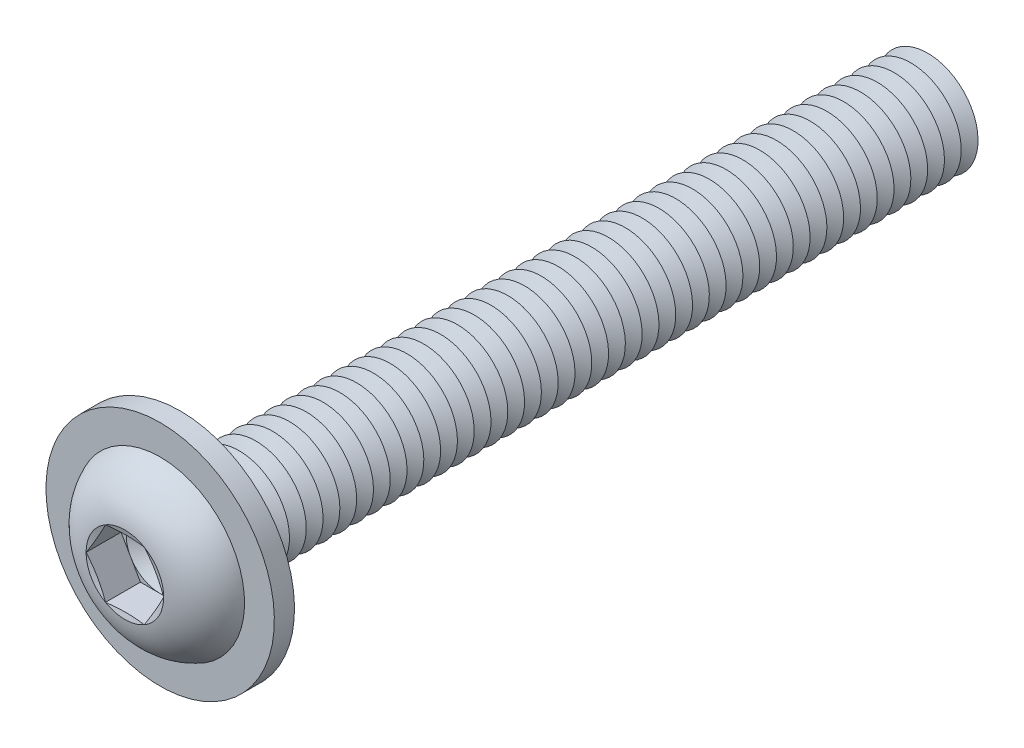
from build123d import *

# Parameters (mm, degrees)
FILLET1_R           = 0.5
LPATTERN1_COUNT     = 45
LPATTERN1_PITCH     = 1
CUT_EXTRUDE1_DEPTH  = 2.08
SKETCH5_R           = 6.8
SKETCH5_R_2         = 3.5
BOSS_EXTRUDE1_DEPTH = 1.2


with BuildPart() as part:
    # Sketch1 → Revolve1 (revolve)
    with BuildSketch(Plane(origin=(0, 0, 0), x_dir=(0, 0, -1), z_dir=(1, 0, 0))):
        with BuildLine():
            Line((0, 3), (0, 5.25))
            ThreePointArc((0, 5.25), (-2.210041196, 4.408189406), (-3.3, 2.3094))
            Line((-3.3, 2.3094), (-2.990599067, 1.1547))
            Line((-2.990599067, 1.1547), (-3.3, 1.1547))
            Line((-3.3, 1.1547), (-3.3, 0))
            Line((-3.3, 0), (45, 0))
            Line((45, 0), (45, 3))
            Line((45, 3), (0, 3))
        make_face()
    revolve(axis=Axis((0, 0, -45), (0, 0, 1)))

    # Fillet1
    fillet1_edges = [part.edges().sort_by_distance(p)[0] for p in [
        (0, -3, 0),
    ]]
    fillet(fillet1_edges, radius=FILLET1_R)

    # Sketch2 → Cut-Revolve1 (revolve, cut)
    with BuildSketch(Plane(origin=(0, 0, 0), x_dir=(0, 0, -1), z_dir=(1, 0, 0))):
        Polygon((44.5, 3), (45.5, 3), (45, 2.133974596), align=None)
    cut_revolve1 = revolve(axis=Axis((0, 0, -45), (0, 0, -1)), mode=Mode.SUBTRACT)

    # LPattern1: Cut-Revolve1 ×45
    with Locations(*[(0, 0, i * LPATTERN1_PITCH) for i in range(1, LPATTERN1_COUNT)]):
        add(cut_revolve1, mode=Mode.SUBTRACT)

    # Sketch3 → Cut-Extrude1 (cut)
    with BuildSketch(Plane.XY.offset(3.3)):
        Polygon((1.1547, 1.999999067), (-1.1547, 1.999999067), (-2.3094, 0), (-1.1547, -1.999999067), (1.1547, -1.999999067), (2.3094, 0), align=None)
    extrude(amount=-CUT_EXTRUDE1_DEPTH, mode=Mode.SUBTRACT)

    # Cut-Extrude2 cone 1 section (on through the dimple's axis) → Cut-Extrude2 (revolve, cut)
    with BuildSketch(Plane(origin=(0, 0, 1.22), x_dir=(0, -1, 0), z_dir=(1, 0, 0))):
        Polygon((0, 0), (1.999999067, 0), (0, 1.1547), align=None)
    revolve(axis=Axis((0, 0, 1.22), (0, 0, -1)), mode=Mode.SUBTRACT)

    # Sketch5 → Boss-Extrude1 (add)
    with BuildSketch(Plane(origin=(0, 0, 0), x_dir=(-1, 0, 0), z_dir=(0, 0, -1))):
        with Locations(Location((0, 0, 0), (0, 0, 90))):
            Circle(SKETCH5_R)
        Circle(SKETCH5_R_2, mode=Mode.SUBTRACT)
    extrude(amount=-BOSS_EXTRUDE1_DEPTH)


solid = part.part
